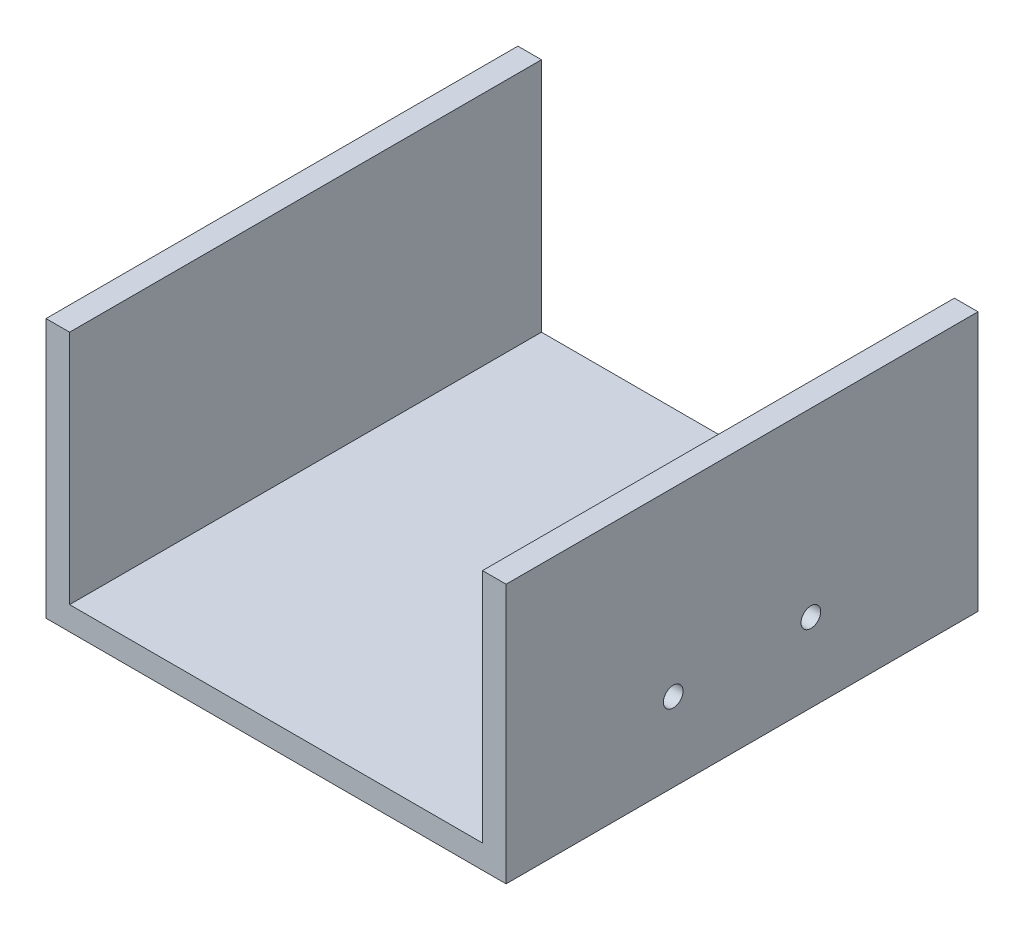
ISO-10303-21;
HEADER;
FILE_DESCRIPTION(('STEP AP214'),'2;1');
FILE_NAME('part.step','',(''),(''),'','','');
FILE_SCHEMA(('AUTOMOTIVE_DESIGN { 1 0 10303 214 1 1 1 1 }'));
ENDSEC;
DATA;
#1=APPLICATION_CONTEXT('core data for automotive mechanical design processes');
#2=APPLICATION_PROTOCOL_DEFINITION('international standard','automotive_design',2000,#1);
#3=PRODUCT_CONTEXT('',#1,'mechanical');
#4=PRODUCT('Part','Part','',(#3));
#5=PRODUCT_RELATED_PRODUCT_CATEGORY('part','',(#4));
#6=PRODUCT_DEFINITION_FORMATION('','',#4);
#7=PRODUCT_DEFINITION_CONTEXT('part definition',#1,'design');
#8=PRODUCT_DEFINITION('design','',#6,#7);
#9=PRODUCT_DEFINITION_SHAPE('','',#8);
#10=(LENGTH_UNIT() NAMED_UNIT(*) SI_UNIT(.MILLI.,.METRE.));
#11=(NAMED_UNIT(*) PLANE_ANGLE_UNIT() SI_UNIT($,.RADIAN.));
#12=(NAMED_UNIT(*) SI_UNIT($,.STERADIAN.) SOLID_ANGLE_UNIT());
#13=UNCERTAINTY_MEASURE_WITH_UNIT(LENGTH_MEASURE(1.E-05),#10,'distance_accuracy_value','');
#14=(GEOMETRIC_REPRESENTATION_CONTEXT(3) GLOBAL_UNCERTAINTY_ASSIGNED_CONTEXT((#13)) GLOBAL_UNIT_ASSIGNED_CONTEXT((#10,
#11,#12)) REPRESENTATION_CONTEXT('',''));
#15=CARTESIAN_POINT('',(0.,0.,0.));
#16=DIRECTION('',(0.,0.,1.));
#17=DIRECTION('',(1.,0.,0.));
#18=AXIS2_PLACEMENT_3D('',#15,#16,#17);
#19=CARTESIAN_POINT('',(52.5,-27.,120.));
#20=DIRECTION('',(1.,0.,0.));
#21=DIRECTION('',(0.,0.,-1.));
#22=AXIS2_PLACEMENT_3D('',#19,#20,#21);
#23=PLANE('',#22);
#24=CARTESIAN_POINT('',(52.5,-13.,42.5));
#25=DIRECTION('',(1.,0.,0.));
#26=DIRECTION('',(0.,0.,-1.));
#27=AXIS2_PLACEMENT_3D('',#24,#25,#26);
#28=CIRCLE('',#27,2.5);
#29=CARTESIAN_POINT('',(52.5,-13.,40.));
#30=VERTEX_POINT('',#29);
#31=EDGE_CURVE('E179',#30,#30,#28,.T.);
#32=ORIENTED_EDGE('',*,*,#31,.T.);
#33=EDGE_LOOP('',(#32));
#34=FACE_BOUND('',#33,.T.);
#35=CARTESIAN_POINT('',(52.5,-13.,77.5));
#36=DIRECTION('',(1.,0.,0.));
#37=DIRECTION('',(0.,0.,-1.));
#38=AXIS2_PLACEMENT_3D('',#35,#36,#37);
#39=CIRCLE('',#38,2.5);
#40=CARTESIAN_POINT('',(52.5,-13.,75.));
#41=VERTEX_POINT('',#40);
#42=EDGE_CURVE('E130',#41,#41,#39,.T.);
#43=ORIENTED_EDGE('',*,*,#42,.T.);
#44=EDGE_LOOP('',(#43));
#45=FACE_BOUND('',#44,.T.);
#46=DIRECTION('',(0.,-1.,0.));
#47=VECTOR('',#46,1.);
#48=CARTESIAN_POINT('',(52.5,-27.,0.));
#49=LINE('',#48,#47);
#50=CARTESIAN_POINT('',(52.5,33.,0.));
#51=VERTEX_POINT('',#50);
#52=CARTESIAN_POINT('',(52.5,-27.,0.));
#53=VERTEX_POINT('',#52);
#54=EDGE_CURVE('E126',#51,#53,#49,.T.);
#55=ORIENTED_EDGE('',*,*,#54,.T.);
#56=DIRECTION('',(0.,0.,-1.));
#57=VECTOR('',#56,1.);
#58=CARTESIAN_POINT('',(52.5,-27.,120.));
#59=LINE('',#58,#57);
#60=CARTESIAN_POINT('',(52.5,-27.,120.));
#61=VERTEX_POINT('',#60);
#62=EDGE_CURVE('E11',#61,#53,#59,.T.);
#63=ORIENTED_EDGE('',*,*,#62,.F.);
#64=DIRECTION('',(0.,-1.,0.));
#65=VECTOR('',#64,1.);
#66=CARTESIAN_POINT('',(52.5,-27.,120.));
#67=LINE('',#66,#65);
#68=CARTESIAN_POINT('',(52.5,33.,120.));
#69=VERTEX_POINT('',#68);
#70=EDGE_CURVE('E141',#69,#61,#67,.T.);
#71=ORIENTED_EDGE('',*,*,#70,.F.);
#72=DIRECTION('',(0.,0.,-1.));
#73=VECTOR('',#72,1.);
#74=CARTESIAN_POINT('',(52.5,33.,120.));
#75=LINE('',#74,#73);
#76=EDGE_CURVE('E122',#69,#51,#75,.T.);
#77=ORIENTED_EDGE('',*,*,#76,.T.);
#78=EDGE_LOOP('',(#55,#63,#71,#77));
#79=FACE_BOUND('',#78,.T.);
#80=ADVANCED_FACE('F30',(#34,#45,#79),#23,.F.);
#81=CARTESIAN_POINT('',(-52.5,-27.,120.));
#82=DIRECTION('',(0.,-1.,0.));
#83=DIRECTION('',(0.,0.,-1.));
#84=AXIS2_PLACEMENT_3D('',#81,#82,#83);
#85=PLANE('',#84);
#86=DIRECTION('',(-1.,0.,0.));
#87=VECTOR('',#86,1.);
#88=CARTESIAN_POINT('',(-52.5,-27.,0.));
#89=LINE('',#88,#87);
#90=CARTESIAN_POINT('',(-52.5,-27.,0.));
#91=VERTEX_POINT('',#90);
#92=EDGE_CURVE('E129',#53,#91,#89,.T.);
#93=ORIENTED_EDGE('',*,*,#92,.T.);
#94=DIRECTION('',(0.,0.,-1.));
#95=VECTOR('',#94,1.);
#96=CARTESIAN_POINT('',(-52.5,-27.,120.));
#97=LINE('',#96,#95);
#98=CARTESIAN_POINT('',(-52.5,-27.,120.));
#99=VERTEX_POINT('',#98);
#100=EDGE_CURVE('E38',#99,#91,#97,.T.);
#101=ORIENTED_EDGE('',*,*,#100,.F.);
#102=DIRECTION('',(-1.,0.,0.));
#103=VECTOR('',#102,1.);
#104=CARTESIAN_POINT('',(-52.5,-27.,120.));
#105=LINE('',#104,#103);
#106=EDGE_CURVE('E89',#61,#99,#105,.T.);
#107=ORIENTED_EDGE('',*,*,#106,.F.);
#108=ORIENTED_EDGE('',*,*,#62,.T.);
#109=EDGE_LOOP('',(#93,#101,#107,#108));
#110=FACE_BOUND('',#109,.T.);
#111=ADVANCED_FACE('F203',(#110),#85,.F.);
#112=CARTESIAN_POINT('',(-52.5,-27.,120.));
#113=DIRECTION('',(-1.,0.,0.));
#114=DIRECTION('',(0.,-1.,0.));
#115=AXIS2_PLACEMENT_3D('',#112,#113,#114);
#116=PLANE('',#115);
#117=DIRECTION('',(0.,1.,0.));
#118=VECTOR('',#117,1.);
#119=CARTESIAN_POINT('',(-52.5,-27.,0.));
#120=LINE('',#119,#118);
#121=CARTESIAN_POINT('',(-52.5,33.,0.));
#122=VERTEX_POINT('',#121);
#123=EDGE_CURVE('E132',#91,#122,#120,.T.);
#124=ORIENTED_EDGE('',*,*,#123,.T.);
#125=DIRECTION('',(0.,0.,-1.));
#126=VECTOR('',#125,1.);
#127=CARTESIAN_POINT('',(-52.5,33.,120.));
#128=LINE('',#127,#126);
#129=CARTESIAN_POINT('',(-52.5,33.,120.));
#130=VERTEX_POINT('',#129);
#131=EDGE_CURVE('E148',#130,#122,#128,.T.);
#132=ORIENTED_EDGE('',*,*,#131,.F.);
#133=DIRECTION('',(0.,1.,0.));
#134=VECTOR('',#133,1.);
#135=CARTESIAN_POINT('',(-52.5,-27.,120.));
#136=LINE('',#135,#134);
#137=EDGE_CURVE('E156',#99,#130,#136,.T.);
#138=ORIENTED_EDGE('',*,*,#137,.F.);
#139=ORIENTED_EDGE('',*,*,#100,.T.);
#140=EDGE_LOOP('',(#124,#132,#138,#139));
#141=FACE_BOUND('',#140,.T.);
#142=ADVANCED_FACE('F154',(#141),#116,.F.);
#143=CARTESIAN_POINT('',(-52.5,33.,120.));
#144=DIRECTION('',(0.,-1.,0.));
#145=DIRECTION('',(1.,0.,0.));
#146=AXIS2_PLACEMENT_3D('',#143,#144,#145);
#147=PLANE('',#146);
#148=DIRECTION('',(-1.,0.,0.));
#149=VECTOR('',#148,1.);
#150=CARTESIAN_POINT('',(-52.5,33.,0.));
#151=LINE('',#150,#149);
#152=CARTESIAN_POINT('',(-58.5,33.,0.));
#153=VERTEX_POINT('',#152);
#154=EDGE_CURVE('E134',#122,#153,#151,.T.);
#155=ORIENTED_EDGE('',*,*,#154,.T.);
#156=DIRECTION('',(0.,0.,-1.));
#157=VECTOR('',#156,1.);
#158=CARTESIAN_POINT('',(-58.5,33.,120.));
#159=LINE('',#158,#157);
#160=CARTESIAN_POINT('',(-58.5,33.,120.));
#161=VERTEX_POINT('',#160);
#162=EDGE_CURVE('E145',#161,#153,#159,.T.);
#163=ORIENTED_EDGE('',*,*,#162,.F.);
#164=DIRECTION('',(-1.,0.,0.));
#165=VECTOR('',#164,1.);
#166=CARTESIAN_POINT('',(-52.5,33.,120.));
#167=LINE('',#166,#165);
#168=EDGE_CURVE('E168',#130,#161,#167,.T.);
#169=ORIENTED_EDGE('',*,*,#168,.F.);
#170=ORIENTED_EDGE('',*,*,#131,.T.);
#171=EDGE_LOOP('',(#155,#163,#169,#170));
#172=FACE_BOUND('',#171,.T.);
#173=ADVANCED_FACE('F164',(#172),#147,.F.);
#174=CARTESIAN_POINT('',(-58.5,33.,120.));
#175=DIRECTION('',(1.,0.,0.));
#176=DIRECTION('',(0.,1.,0.));
#177=AXIS2_PLACEMENT_3D('',#174,#175,#176);
#178=PLANE('',#177);
#179=DIRECTION('',(0.,-1.,0.));
#180=VECTOR('',#179,1.);
#181=CARTESIAN_POINT('',(-58.5,33.,0.));
#182=LINE('',#181,#180);
#183=CARTESIAN_POINT('',(-58.5,-33.,0.));
#184=VERTEX_POINT('',#183);
#185=EDGE_CURVE('E136',#153,#184,#182,.T.);
#186=ORIENTED_EDGE('',*,*,#185,.T.);
#187=DIRECTION('',(0.,0.,-1.));
#188=VECTOR('',#187,1.);
#189=CARTESIAN_POINT('',(-58.5,-33.,120.));
#190=LINE('',#189,#188);
#191=CARTESIAN_POINT('',(-58.5,-33.,120.));
#192=VERTEX_POINT('',#191);
#193=EDGE_CURVE('E117',#192,#184,#190,.T.);
#194=ORIENTED_EDGE('',*,*,#193,.F.);
#195=DIRECTION('',(0.,-1.,0.));
#196=VECTOR('',#195,1.);
#197=CARTESIAN_POINT('',(-58.5,33.,120.));
#198=LINE('',#197,#196);
#199=EDGE_CURVE('E108',#161,#192,#198,.T.);
#200=ORIENTED_EDGE('',*,*,#199,.F.);
#201=ORIENTED_EDGE('',*,*,#162,.T.);
#202=EDGE_LOOP('',(#186,#194,#200,#201));
#203=FACE_BOUND('',#202,.T.);
#204=ADVANCED_FACE('F167',(#203),#178,.F.);
#205=CARTESIAN_POINT('',(58.5,-33.,120.));
#206=DIRECTION('',(0.,1.,0.));
#207=DIRECTION('',(-1.,0.,0.));
#208=AXIS2_PLACEMENT_3D('',#205,#206,#207);
#209=PLANE('',#208);
#210=DIRECTION('',(1.,0.,0.));
#211=VECTOR('',#210,1.);
#212=CARTESIAN_POINT('',(58.5,-33.,0.));
#213=LINE('',#212,#211);
#214=CARTESIAN_POINT('',(58.5,-33.,0.));
#215=VERTEX_POINT('',#214);
#216=EDGE_CURVE('E116',#184,#215,#213,.T.);
#217=ORIENTED_EDGE('',*,*,#216,.T.);
#218=DIRECTION('',(0.,0.,-1.));
#219=VECTOR('',#218,1.);
#220=CARTESIAN_POINT('',(58.5,-33.,120.));
#221=LINE('',#220,#219);
#222=CARTESIAN_POINT('',(58.5,-33.,120.));
#223=VERTEX_POINT('',#222);
#224=EDGE_CURVE('E113',#223,#215,#221,.T.);
#225=ORIENTED_EDGE('',*,*,#224,.F.);
#226=DIRECTION('',(1.,0.,0.));
#227=VECTOR('',#226,1.);
#228=CARTESIAN_POINT('',(58.5,-33.,120.));
#229=LINE('',#228,#227);
#230=EDGE_CURVE('E102',#192,#223,#229,.T.);
#231=ORIENTED_EDGE('',*,*,#230,.F.);
#232=ORIENTED_EDGE('',*,*,#193,.T.);
#233=EDGE_LOOP('',(#217,#225,#231,#232));
#234=FACE_BOUND('',#233,.T.);
#235=ADVANCED_FACE('F114',(#234),#209,.F.);
#236=CARTESIAN_POINT('',(58.5,33.,120.));
#237=DIRECTION('',(-1.,0.,0.));
#238=DIRECTION('',(0.,0.,1.));
#239=AXIS2_PLACEMENT_3D('',#236,#237,#238);
#240=PLANE('',#239);
#241=CARTESIAN_POINT('',(58.5,-13.,42.5));
#242=DIRECTION('',(1.,0.,0.));
#243=DIRECTION('',(0.,0.,-1.));
#244=AXIS2_PLACEMENT_3D('',#241,#242,#243);
#245=CIRCLE('',#244,2.5);
#246=CARTESIAN_POINT('',(58.5,-13.,40.));
#247=VERTEX_POINT('',#246);
#248=EDGE_CURVE('E182',#247,#247,#245,.T.);
#249=ORIENTED_EDGE('',*,*,#248,.F.);
#250=EDGE_LOOP('',(#249));
#251=FACE_BOUND('',#250,.T.);
#252=CARTESIAN_POINT('',(58.5,-13.,77.5));
#253=DIRECTION('',(1.,0.,0.));
#254=DIRECTION('',(0.,0.,-1.));
#255=AXIS2_PLACEMENT_3D('',#252,#253,#254);
#256=CIRCLE('',#255,2.5);
#257=CARTESIAN_POINT('',(58.5,-13.,75.));
#258=VERTEX_POINT('',#257);
#259=EDGE_CURVE('E176',#258,#258,#256,.T.);
#260=ORIENTED_EDGE('',*,*,#259,.F.);
#261=EDGE_LOOP('',(#260));
#262=FACE_BOUND('',#261,.T.);
#263=DIRECTION('',(0.,1.,0.));
#264=VECTOR('',#263,1.);
#265=CARTESIAN_POINT('',(58.5,33.,0.));
#266=LINE('',#265,#264);
#267=CARTESIAN_POINT('',(58.5,33.,0.));
#268=VERTEX_POINT('',#267);
#269=EDGE_CURVE('E75',#215,#268,#266,.T.);
#270=ORIENTED_EDGE('',*,*,#269,.T.);
#271=DIRECTION('',(0.,0.,-1.));
#272=VECTOR('',#271,1.);
#273=CARTESIAN_POINT('',(58.5,33.,120.));
#274=LINE('',#273,#272);
#275=CARTESIAN_POINT('',(58.5,33.,120.));
#276=VERTEX_POINT('',#275);
#277=EDGE_CURVE('E118',#276,#268,#274,.T.);
#278=ORIENTED_EDGE('',*,*,#277,.F.);
#279=DIRECTION('',(0.,1.,0.));
#280=VECTOR('',#279,1.);
#281=CARTESIAN_POINT('',(58.5,33.,120.));
#282=LINE('',#281,#280);
#283=EDGE_CURVE('E106',#223,#276,#282,.T.);
#284=ORIENTED_EDGE('',*,*,#283,.F.);
#285=ORIENTED_EDGE('',*,*,#224,.T.);
#286=EDGE_LOOP('',(#270,#278,#284,#285));
#287=FACE_BOUND('',#286,.T.);
#288=ADVANCED_FACE('F120',(#251,#262,#287),#240,.F.);
#289=CARTESIAN_POINT('',(52.5,33.,120.));
#290=DIRECTION('',(0.,-1.,0.));
#291=DIRECTION('',(1.,0.,0.));
#292=AXIS2_PLACEMENT_3D('',#289,#290,#291);
#293=PLANE('',#292);
#294=DIRECTION('',(-1.,0.,0.));
#295=VECTOR('',#294,1.);
#296=CARTESIAN_POINT('',(52.5,33.,0.));
#297=LINE('',#296,#295);
#298=EDGE_CURVE('E81',#268,#51,#297,.T.);
#299=ORIENTED_EDGE('',*,*,#298,.T.);
#300=ORIENTED_EDGE('',*,*,#76,.F.);
#301=DIRECTION('',(-1.,0.,0.));
#302=VECTOR('',#301,1.);
#303=CARTESIAN_POINT('',(52.5,33.,120.));
#304=LINE('',#303,#302);
#305=EDGE_CURVE('E46',#276,#69,#304,.T.);
#306=ORIENTED_EDGE('',*,*,#305,.F.);
#307=ORIENTED_EDGE('',*,*,#277,.T.);
#308=EDGE_LOOP('',(#299,#300,#306,#307));
#309=FACE_BOUND('',#308,.T.);
#310=ADVANCED_FACE('F191',(#309),#293,.F.);
#311=CARTESIAN_POINT('',(52.5,33.,120.));
#312=DIRECTION('',(0.,0.,-1.));
#313=DIRECTION('',(-1.,0.,0.));
#314=AXIS2_PLACEMENT_3D('',#311,#312,#313);
#315=PLANE('',#314);
#316=ORIENTED_EDGE('',*,*,#70,.T.);
#317=ORIENTED_EDGE('',*,*,#106,.T.);
#318=ORIENTED_EDGE('',*,*,#137,.T.);
#319=ORIENTED_EDGE('',*,*,#168,.T.);
#320=ORIENTED_EDGE('',*,*,#199,.T.);
#321=ORIENTED_EDGE('',*,*,#230,.T.);
#322=ORIENTED_EDGE('',*,*,#283,.T.);
#323=ORIENTED_EDGE('',*,*,#305,.T.);
#324=EDGE_LOOP('',(#316,#317,#318,#319,#320,#321,#322,#323));
#325=FACE_BOUND('',#324,.T.);
#326=ADVANCED_FACE('F104',(#325),#315,.F.);
#327=CARTESIAN_POINT('',(52.5,33.,0.));
#328=DIRECTION('',(0.,0.,-1.));
#329=DIRECTION('',(-1.,0.,0.));
#330=AXIS2_PLACEMENT_3D('',#327,#328,#329);
#331=PLANE('',#330);
#332=ORIENTED_EDGE('',*,*,#54,.F.);
#333=ORIENTED_EDGE('',*,*,#298,.F.);
#334=ORIENTED_EDGE('',*,*,#269,.F.);
#335=ORIENTED_EDGE('',*,*,#216,.F.);
#336=ORIENTED_EDGE('',*,*,#185,.F.);
#337=ORIENTED_EDGE('',*,*,#154,.F.);
#338=ORIENTED_EDGE('',*,*,#123,.F.);
#339=ORIENTED_EDGE('',*,*,#92,.F.);
#340=EDGE_LOOP('',(#332,#333,#334,#335,#336,#337,#338,#339));
#341=FACE_BOUND('',#340,.T.);
#342=ADVANCED_FACE('F160',(#341),#331,.T.);
#343=CARTESIAN_POINT('',(58.5,-13.,77.5));
#344=DIRECTION('',(1.,0.,0.));
#345=DIRECTION('',(0.,0.,-1.));
#346=AXIS2_PLACEMENT_3D('',#343,#344,#345);
#347=CYLINDRICAL_SURFACE('',#346,2.5);
#348=ORIENTED_EDGE('',*,*,#259,.T.);
#349=EDGE_LOOP('',(#348));
#350=FACE_BOUND('',#349,.T.);
#351=ORIENTED_EDGE('',*,*,#42,.F.);
#352=EDGE_LOOP('',(#351));
#353=FACE_BOUND('',#352,.T.);
#354=ADVANCED_FACE('F195',(#350,#353),#347,.F.);
#355=CARTESIAN_POINT('',(58.5,-13.,42.5));
#356=DIRECTION('',(1.,0.,0.));
#357=DIRECTION('',(0.,0.,-1.));
#358=AXIS2_PLACEMENT_3D('',#355,#356,#357);
#359=CYLINDRICAL_SURFACE('',#358,2.5);
#360=ORIENTED_EDGE('',*,*,#248,.T.);
#361=EDGE_LOOP('',(#360));
#362=FACE_BOUND('',#361,.T.);
#363=ORIENTED_EDGE('',*,*,#31,.F.);
#364=EDGE_LOOP('',(#363));
#365=FACE_BOUND('',#364,.T.);
#366=ADVANCED_FACE('F186',(#362,#365),#359,.F.);
#367=CLOSED_SHELL('',(#80,#111,#142,#173,#204,#235,#288,#310,#326,#342,#354,#366));
#368=MANIFOLD_SOLID_BREP('B2',#367);
#369=ADVANCED_BREP_SHAPE_REPRESENTATION('',(#18,#368),#14);
#370=SHAPE_DEFINITION_REPRESENTATION(#9,#369);
ENDSEC;
END-ISO-10303-21;
